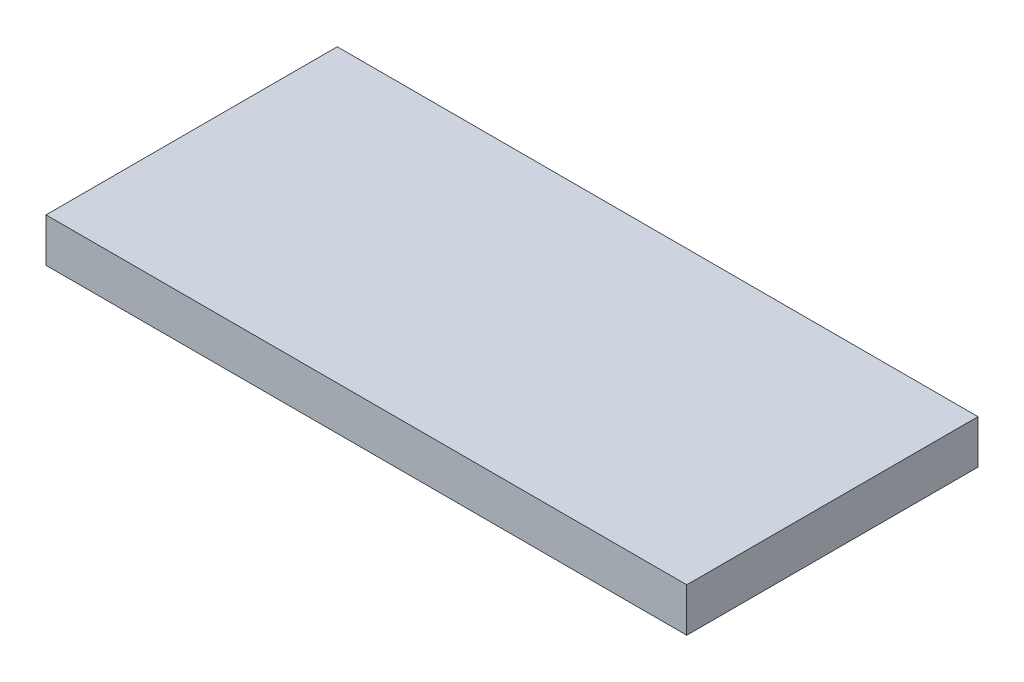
ISO-10303-21;
HEADER;
FILE_DESCRIPTION(('STEP AP214'),'2;1');
FILE_NAME('part.step','',(''),(''),'','','');
FILE_SCHEMA(('AUTOMOTIVE_DESIGN { 1 0 10303 214 1 1 1 1 }'));
ENDSEC;
DATA;
#1=APPLICATION_CONTEXT('core data for automotive mechanical design processes');
#2=APPLICATION_PROTOCOL_DEFINITION('international standard','automotive_design',2000,#1);
#3=PRODUCT_CONTEXT('',#1,'mechanical');
#4=PRODUCT('Part','Part','',(#3));
#5=PRODUCT_RELATED_PRODUCT_CATEGORY('part','',(#4));
#6=PRODUCT_DEFINITION_FORMATION('','',#4);
#7=PRODUCT_DEFINITION_CONTEXT('part definition',#1,'design');
#8=PRODUCT_DEFINITION('design','',#6,#7);
#9=PRODUCT_DEFINITION_SHAPE('','',#8);
#10=(LENGTH_UNIT() NAMED_UNIT(*) SI_UNIT(.MILLI.,.METRE.));
#11=(NAMED_UNIT(*) PLANE_ANGLE_UNIT() SI_UNIT($,.RADIAN.));
#12=(NAMED_UNIT(*) SI_UNIT($,.STERADIAN.) SOLID_ANGLE_UNIT());
#13=UNCERTAINTY_MEASURE_WITH_UNIT(LENGTH_MEASURE(1.E-05),#10,'distance_accuracy_value','');
#14=(GEOMETRIC_REPRESENTATION_CONTEXT(3) GLOBAL_UNCERTAINTY_ASSIGNED_CONTEXT((#13)) GLOBAL_UNIT_ASSIGNED_CONTEXT((#10,
#11,#12)) REPRESENTATION_CONTEXT('',''));
#15=CARTESIAN_POINT('',(0.,0.,0.));
#16=DIRECTION('',(0.,0.,1.));
#17=DIRECTION('',(1.,0.,0.));
#18=AXIS2_PLACEMENT_3D('',#15,#16,#17);
#19=CARTESIAN_POINT('',(34.925,4.7625,-15.875));
#20=DIRECTION('',(-1.,0.,0.));
#21=DIRECTION('',(0.,0.,1.));
#22=AXIS2_PLACEMENT_3D('',#19,#20,#21);
#23=PLANE('',#22);
#24=DIRECTION('',(0.,0.,-1.));
#25=VECTOR('',#24,1.);
#26=CARTESIAN_POINT('',(34.925,0.,-15.875));
#27=LINE('',#26,#25);
#28=CARTESIAN_POINT('',(34.925,0.,15.875));
#29=VERTEX_POINT('',#28);
#30=CARTESIAN_POINT('',(34.925,0.,-15.875));
#31=VERTEX_POINT('',#30);
#32=EDGE_CURVE('E97',#29,#31,#27,.T.);
#33=ORIENTED_EDGE('',*,*,#32,.T.);
#34=DIRECTION('',(0.,-1.,0.));
#35=VECTOR('',#34,1.);
#36=CARTESIAN_POINT('',(34.925,4.7625,-15.875));
#37=LINE('',#36,#35);
#38=CARTESIAN_POINT('',(34.925,4.7625,-15.875));
#39=VERTEX_POINT('',#38);
#40=EDGE_CURVE('E11',#39,#31,#37,.T.);
#41=ORIENTED_EDGE('',*,*,#40,.F.);
#42=DIRECTION('',(0.,0.,-1.));
#43=VECTOR('',#42,1.);
#44=CARTESIAN_POINT('',(34.925,4.7625,-15.875));
#45=LINE('',#44,#43);
#46=CARTESIAN_POINT('',(34.925,4.7625,15.875));
#47=VERTEX_POINT('',#46);
#48=EDGE_CURVE('E85',#47,#39,#45,.T.);
#49=ORIENTED_EDGE('',*,*,#48,.F.);
#50=DIRECTION('',(0.,-1.,0.));
#51=VECTOR('',#50,1.);
#52=CARTESIAN_POINT('',(34.925,4.7625,15.875));
#53=LINE('',#52,#51);
#54=EDGE_CURVE('E93',#47,#29,#53,.T.);
#55=ORIENTED_EDGE('',*,*,#54,.T.);
#56=EDGE_LOOP('',(#33,#41,#49,#55));
#57=FACE_BOUND('',#56,.T.);
#58=ADVANCED_FACE('F34',(#57),#23,.F.);
#59=CARTESIAN_POINT('',(-34.925,4.7625,-15.875));
#60=DIRECTION('',(0.,0.,1.));
#61=DIRECTION('',(1.,0.,0.));
#62=AXIS2_PLACEMENT_3D('',#59,#60,#61);
#63=PLANE('',#62);
#64=DIRECTION('',(-1.,0.,0.));
#65=VECTOR('',#64,1.);
#66=CARTESIAN_POINT('',(-34.925,0.,-15.875));
#67=LINE('',#66,#65);
#68=CARTESIAN_POINT('',(-34.925,0.,-15.875));
#69=VERTEX_POINT('',#68);
#70=EDGE_CURVE('E89',#31,#69,#67,.T.);
#71=ORIENTED_EDGE('',*,*,#70,.T.);
#72=DIRECTION('',(0.,-1.,0.));
#73=VECTOR('',#72,1.);
#74=CARTESIAN_POINT('',(-34.925,4.7625,-15.875));
#75=LINE('',#74,#73);
#76=CARTESIAN_POINT('',(-34.925,4.7625,-15.875));
#77=VERTEX_POINT('',#76);
#78=EDGE_CURVE('E42',#77,#69,#75,.T.);
#79=ORIENTED_EDGE('',*,*,#78,.F.);
#80=DIRECTION('',(-1.,0.,0.));
#81=VECTOR('',#80,1.);
#82=CARTESIAN_POINT('',(-34.925,4.7625,-15.875));
#83=LINE('',#82,#81);
#84=EDGE_CURVE('E80',#39,#77,#83,.T.);
#85=ORIENTED_EDGE('',*,*,#84,.F.);
#86=ORIENTED_EDGE('',*,*,#40,.T.);
#87=EDGE_LOOP('',(#71,#79,#85,#86));
#88=FACE_BOUND('',#87,.T.);
#89=ADVANCED_FACE('F88',(#88),#63,.F.);
#90=CARTESIAN_POINT('',(-34.925,4.7625,-15.875));
#91=DIRECTION('',(1.,0.,0.));
#92=DIRECTION('',(0.,0.,-1.));
#93=AXIS2_PLACEMENT_3D('',#90,#91,#92);
#94=PLANE('',#93);
#95=DIRECTION('',(0.,0.,1.));
#96=VECTOR('',#95,1.);
#97=CARTESIAN_POINT('',(-34.925,0.,-15.875));
#98=LINE('',#97,#96);
#99=CARTESIAN_POINT('',(-34.925,0.,15.875));
#100=VERTEX_POINT('',#99);
#101=EDGE_CURVE('E67',#69,#100,#98,.T.);
#102=ORIENTED_EDGE('',*,*,#101,.T.);
#103=DIRECTION('',(0.,-1.,0.));
#104=VECTOR('',#103,1.);
#105=CARTESIAN_POINT('',(-34.925,4.7625,15.875));
#106=LINE('',#105,#104);
#107=CARTESIAN_POINT('',(-34.925,4.7625,15.875));
#108=VERTEX_POINT('',#107);
#109=EDGE_CURVE('E90',#108,#100,#106,.T.);
#110=ORIENTED_EDGE('',*,*,#109,.F.);
#111=DIRECTION('',(0.,0.,1.));
#112=VECTOR('',#111,1.);
#113=CARTESIAN_POINT('',(-34.925,4.7625,-15.875));
#114=LINE('',#113,#112);
#115=EDGE_CURVE('E83',#77,#108,#114,.T.);
#116=ORIENTED_EDGE('',*,*,#115,.F.);
#117=ORIENTED_EDGE('',*,*,#78,.T.);
#118=EDGE_LOOP('',(#102,#110,#116,#117));
#119=FACE_BOUND('',#118,.T.);
#120=ADVANCED_FACE('F91',(#119),#94,.F.);
#121=CARTESIAN_POINT('',(-34.925,4.7625,15.875));
#122=DIRECTION('',(0.,0.,-1.));
#123=DIRECTION('',(-1.,0.,0.));
#124=AXIS2_PLACEMENT_3D('',#121,#122,#123);
#125=PLANE('',#124);
#126=DIRECTION('',(1.,0.,0.));
#127=VECTOR('',#126,1.);
#128=CARTESIAN_POINT('',(-34.925,0.,15.875));
#129=LINE('',#128,#127);
#130=EDGE_CURVE('E73',#100,#29,#129,.T.);
#131=ORIENTED_EDGE('',*,*,#130,.T.);
#132=ORIENTED_EDGE('',*,*,#54,.F.);
#133=DIRECTION('',(1.,0.,0.));
#134=VECTOR('',#133,1.);
#135=CARTESIAN_POINT('',(-34.925,4.7625,15.875));
#136=LINE('',#135,#134);
#137=EDGE_CURVE('E50',#108,#47,#136,.T.);
#138=ORIENTED_EDGE('',*,*,#137,.F.);
#139=ORIENTED_EDGE('',*,*,#109,.T.);
#140=EDGE_LOOP('',(#131,#132,#138,#139));
#141=FACE_BOUND('',#140,.T.);
#142=ADVANCED_FACE('F104',(#141),#125,.F.);
#143=CARTESIAN_POINT('',(34.925,4.7625,15.875));
#144=DIRECTION('',(0.,1.,0.));
#145=DIRECTION('',(0.,0.,1.));
#146=AXIS2_PLACEMENT_3D('',#143,#144,#145);
#147=PLANE('',#146);
#148=ORIENTED_EDGE('',*,*,#48,.T.);
#149=ORIENTED_EDGE('',*,*,#84,.T.);
#150=ORIENTED_EDGE('',*,*,#115,.T.);
#151=ORIENTED_EDGE('',*,*,#137,.T.);
#152=EDGE_LOOP('',(#148,#149,#150,#151));
#153=FACE_BOUND('',#152,.T.);
#154=ADVANCED_FACE('F81',(#153),#147,.T.);
#155=CARTESIAN_POINT('',(34.925,0.,15.875));
#156=DIRECTION('',(0.,1.,0.));
#157=DIRECTION('',(0.,0.,1.));
#158=AXIS2_PLACEMENT_3D('',#155,#156,#157);
#159=PLANE('',#158);
#160=ORIENTED_EDGE('',*,*,#32,.F.);
#161=ORIENTED_EDGE('',*,*,#130,.F.);
#162=ORIENTED_EDGE('',*,*,#101,.F.);
#163=ORIENTED_EDGE('',*,*,#70,.F.);
#164=EDGE_LOOP('',(#160,#161,#162,#163));
#165=FACE_BOUND('',#164,.T.);
#166=ADVANCED_FACE('F107',(#165),#159,.F.);
#167=CLOSED_SHELL('',(#58,#89,#120,#142,#154,#166));
#168=MANIFOLD_SOLID_BREP('B2',#167);
#169=ADVANCED_BREP_SHAPE_REPRESENTATION('',(#18,#168),#14);
#170=SHAPE_DEFINITION_REPRESENTATION(#9,#169);
ENDSEC;
END-ISO-10303-21;
